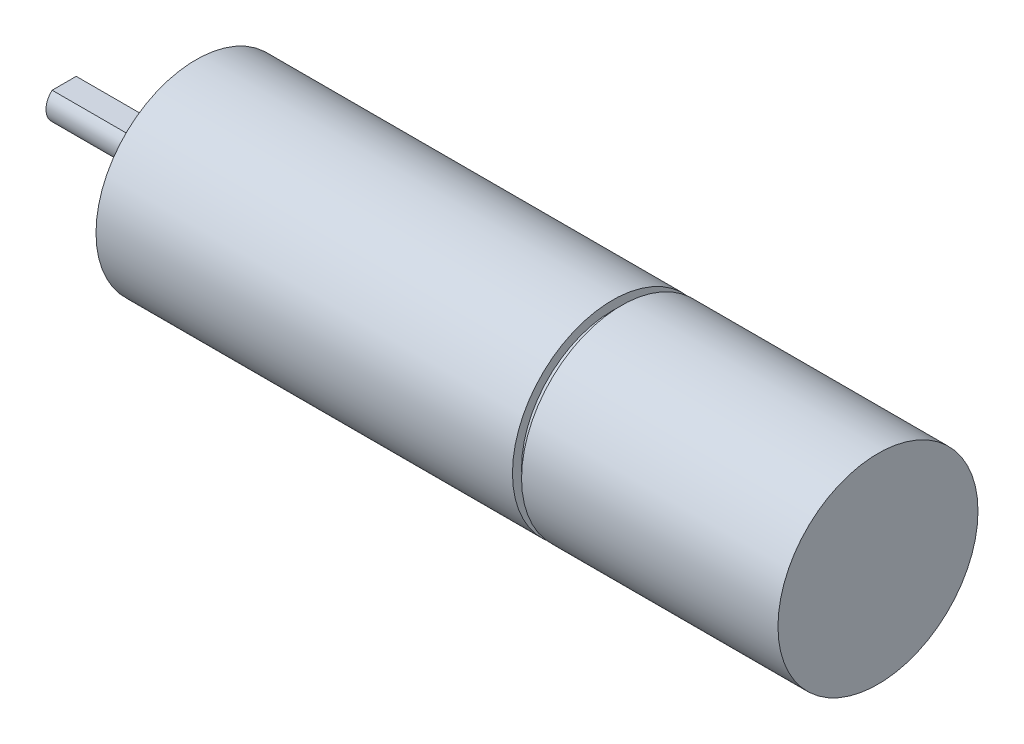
from build123d import *

# Parameters (mm, degrees)
SKETCH3_W                    = 10.552691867
SKETCH3_H                    = 3.433562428
CUT_EXTRUDE1_DEPTH           = 11.35
M2_5X0_45_TAPPED_HOLE1_D     = 2.05
M2_5X0_45_TAPPED_HOLE1_DEPTH = 6.35
M2_5X0_45_TAPPED_HOLE1_TIP   = 0.615882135


with BuildPart() as part:
    # Sketch2 → Revolve1 (revolve)
    with BuildSketch(Plane(origin=(0, 0, 0), x_dir=(1, 0, 0), z_dir=(0, 1, 0))):
        Polygon((-60.3, 0), (-60.3, 2), (-48.95, 2), (-48.95, 3.5), (-47.1, 3.5), (-47.1, 5), (-45.8, 5), (-45.8, 11), (0, 11), (0, 10), (1, 10), (1, 11), (29.2, 11), (29.2, 0), align=None)
    revolve(axis=Axis((0, 0, 0), (-1, 0, 0)))

    # Sketch3 → Cut-Extrude1 (cut)
    with BuildSketch(Plane.ZY.offset(60.3)):
        with Locations((0.787514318, 3.216781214)):
            Rectangle(SKETCH3_W, SKETCH3_H)
    extrude(amount=-CUT_EXTRUDE1_DEPTH, mode=Mode.SUBTRACT)

    # M2.5x0.45 Tapped Hole1
    with Locations(Plane.ZY.offset(45.8)):
        with Locations((0, 7), (6.062177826, -3.5), (-6.062177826, -3.5)):
            Hole(M2_5X0_45_TAPPED_HOLE1_D / 2, depth=M2_5X0_45_TAPPED_HOLE1_DEPTH)
            with Locations((0, 0, -(M2_5X0_45_TAPPED_HOLE1_DEPTH + M2_5X0_45_TAPPED_HOLE1_TIP / 2))):  # 118° drill point
                Cone(0, M2_5X0_45_TAPPED_HOLE1_D / 2, M2_5X0_45_TAPPED_HOLE1_TIP, mode=Mode.SUBTRACT)


solid = part.part
